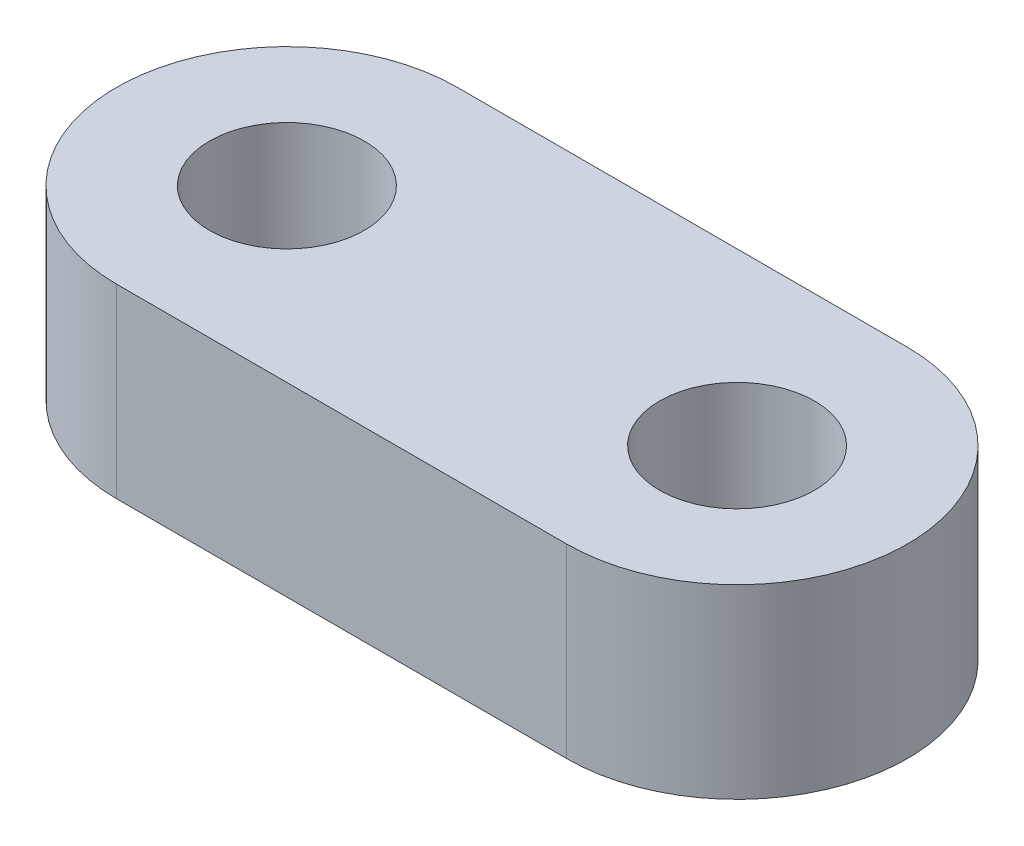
ISO-10303-21;
HEADER;
FILE_DESCRIPTION(('STEP AP214'),'2;1');
FILE_NAME('part.step','',(''),(''),'','','');
FILE_SCHEMA(('AUTOMOTIVE_DESIGN { 1 0 10303 214 1 1 1 1 }'));
ENDSEC;
DATA;
#1=APPLICATION_CONTEXT('core data for automotive mechanical design processes');
#2=APPLICATION_PROTOCOL_DEFINITION('international standard','automotive_design',2000,#1);
#3=PRODUCT_CONTEXT('',#1,'mechanical');
#4=PRODUCT('Part','Part','',(#3));
#5=PRODUCT_RELATED_PRODUCT_CATEGORY('part','',(#4));
#6=PRODUCT_DEFINITION_FORMATION('','',#4);
#7=PRODUCT_DEFINITION_CONTEXT('part definition',#1,'design');
#8=PRODUCT_DEFINITION('design','',#6,#7);
#9=PRODUCT_DEFINITION_SHAPE('','',#8);
#10=(LENGTH_UNIT() NAMED_UNIT(*) SI_UNIT(.MILLI.,.METRE.));
#11=(NAMED_UNIT(*) PLANE_ANGLE_UNIT() SI_UNIT($,.RADIAN.));
#12=(NAMED_UNIT(*) SI_UNIT($,.STERADIAN.) SOLID_ANGLE_UNIT());
#13=UNCERTAINTY_MEASURE_WITH_UNIT(LENGTH_MEASURE(1.E-05),#10,'distance_accuracy_value','');
#14=(GEOMETRIC_REPRESENTATION_CONTEXT(3) GLOBAL_UNCERTAINTY_ASSIGNED_CONTEXT((#13)) GLOBAL_UNIT_ASSIGNED_CONTEXT((#10,
#11,#12)) REPRESENTATION_CONTEXT('',''));
#15=CARTESIAN_POINT('',(0.,0.,0.));
#16=DIRECTION('',(0.,0.,1.));
#17=DIRECTION('',(1.,0.,0.));
#18=AXIS2_PLACEMENT_3D('',#15,#16,#17);
#19=CARTESIAN_POINT('',(14.53,3.00000000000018,0.));
#20=DIRECTION('',(0.,1.,0.));
#21=DIRECTION('',(-1.,0.,0.));
#22=AXIS2_PLACEMENT_3D('',#19,#20,#21);
#23=CYLINDRICAL_SURFACE('',#22,2.5);
#24=CARTESIAN_POINT('',(14.53,3.00000000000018,0.));
#25=DIRECTION('',(0.,1.,0.));
#26=DIRECTION('',(-1.,0.,0.));
#27=AXIS2_PLACEMENT_3D('',#24,#25,#26);
#28=CIRCLE('',#27,2.5);
#29=CARTESIAN_POINT('',(12.03,3.00000000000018,0.));
#30=VERTEX_POINT('',#29);
#31=EDGE_CURVE('E81',#30,#30,#28,.T.);
#32=ORIENTED_EDGE('',*,*,#31,.T.);
#33=EDGE_LOOP('',(#32));
#34=FACE_BOUND('',#33,.T.);
#35=CARTESIAN_POINT('',(14.53,-2.99999999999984,0.));
#36=DIRECTION('',(0.,1.,0.));
#37=DIRECTION('',(-1.,0.,0.));
#38=AXIS2_PLACEMENT_3D('',#35,#36,#37);
#39=CIRCLE('',#38,2.5);
#40=CARTESIAN_POINT('',(12.03,-2.99999999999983,0.));
#41=VERTEX_POINT('',#40);
#42=EDGE_CURVE('E18',#41,#41,#39,.T.);
#43=ORIENTED_EDGE('',*,*,#42,.F.);
#44=EDGE_LOOP('',(#43));
#45=FACE_BOUND('',#44,.T.);
#46=ADVANCED_FACE('F14',(#34,#45),#23,.F.);
#47=CARTESIAN_POINT('',(0.,3.00000000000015,0.));
#48=DIRECTION('',(0.,1.,0.));
#49=DIRECTION('',(-1.,0.,0.));
#50=AXIS2_PLACEMENT_3D('',#47,#48,#49);
#51=CYLINDRICAL_SURFACE('',#50,2.5);
#52=CARTESIAN_POINT('',(0.,3.00000000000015,0.));
#53=DIRECTION('',(0.,1.,0.));
#54=DIRECTION('',(-1.,0.,0.));
#55=AXIS2_PLACEMENT_3D('',#52,#53,#54);
#56=CIRCLE('',#55,2.5);
#57=CARTESIAN_POINT('',(-2.49999999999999,3.00000000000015,0.));
#58=VERTEX_POINT('',#57);
#59=EDGE_CURVE('E84',#58,#58,#56,.T.);
#60=ORIENTED_EDGE('',*,*,#59,.T.);
#61=EDGE_LOOP('',(#60));
#62=FACE_BOUND('',#61,.T.);
#63=CARTESIAN_POINT('',(0.,-2.99999999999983,0.));
#64=DIRECTION('',(0.,1.,0.));
#65=DIRECTION('',(-1.,0.,0.));
#66=AXIS2_PLACEMENT_3D('',#63,#64,#65);
#67=CIRCLE('',#66,2.5);
#68=CARTESIAN_POINT('',(-2.5,-2.99999999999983,0.));
#69=VERTEX_POINT('',#68);
#70=EDGE_CURVE('E75',#69,#69,#67,.T.);
#71=ORIENTED_EDGE('',*,*,#70,.F.);
#72=EDGE_LOOP('',(#71));
#73=FACE_BOUND('',#72,.T.);
#74=ADVANCED_FACE('F155',(#62,#73),#51,.F.);
#75=CARTESIAN_POINT('',(0.,1.83880688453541E-13,-5.50000000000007));
#76=DIRECTION('',(0.,0.,1.));
#77=DIRECTION('',(-1.,0.,0.));
#78=AXIS2_PLACEMENT_3D('',#75,#76,#77);
#79=PLANE('',#78);
#80=DIRECTION('',(0.,1.,0.));
#81=VECTOR('',#80,1.);
#82=CARTESIAN_POINT('',(14.53,1.6306400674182E-13,-5.50000000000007));
#83=LINE('',#82,#81);
#84=CARTESIAN_POINT('',(14.53,-2.99999999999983,-5.5));
#85=VERTEX_POINT('',#84);
#86=CARTESIAN_POINT('',(14.53,3.00000000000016,-5.50000000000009));
#87=VERTEX_POINT('',#86);
#88=EDGE_CURVE('E54',#85,#87,#83,.T.);
#89=ORIENTED_EDGE('',*,*,#88,.F.);
#90=DIRECTION('',(-1.,0.,0.));
#91=VECTOR('',#90,1.);
#92=CARTESIAN_POINT('',(0.,-2.99999999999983,-5.5));
#93=LINE('',#92,#91);
#94=CARTESIAN_POINT('',(0.,-2.99999999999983,-5.5));
#95=VERTEX_POINT('',#94);
#96=EDGE_CURVE('E69',#95,#85,#93,.F.);
#97=ORIENTED_EDGE('',*,*,#96,.F.);
#98=DIRECTION('',(0.,-1.,0.));
#99=VECTOR('',#98,1.);
#100=CARTESIAN_POINT('',(0.,1.83880688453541E-13,-5.50000000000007));
#101=LINE('',#100,#99);
#102=CARTESIAN_POINT('',(0.,3.00000000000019,-5.50000000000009));
#103=VERTEX_POINT('',#102);
#104=EDGE_CURVE('E59',#103,#95,#101,.T.);
#105=ORIENTED_EDGE('',*,*,#104,.F.);
#106=DIRECTION('',(1.,0.,0.));
#107=VECTOR('',#106,1.);
#108=CARTESIAN_POINT('',(0.,3.00000000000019,-5.50000000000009));
#109=LINE('',#108,#107);
#110=EDGE_CURVE('E89',#103,#87,#109,.T.);
#111=ORIENTED_EDGE('',*,*,#110,.T.);
#112=EDGE_LOOP('',(#89,#97,#105,#111));
#113=FACE_BOUND('',#112,.T.);
#114=ADVANCED_FACE('F73',(#113),#79,.F.);
#115=CARTESIAN_POINT('',(14.53,1.80411241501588E-13,0.));
#116=DIRECTION('',(0.,1.,0.));
#117=DIRECTION('',(-1.,0.,0.));
#118=AXIS2_PLACEMENT_3D('',#115,#116,#117);
#119=CYLINDRICAL_SURFACE('',#118,5.5);
#120=DIRECTION('',(0.,-1.,0.));
#121=VECTOR('',#120,1.);
#122=CARTESIAN_POINT('',(14.53,1.97758476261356E-13,5.5));
#123=LINE('',#122,#121);
#124=CARTESIAN_POINT('',(14.53,3.00000000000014,5.5));
#125=VERTEX_POINT('',#124);
#126=CARTESIAN_POINT('',(14.53,-2.99999999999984,5.5));
#127=VERTEX_POINT('',#126);
#128=EDGE_CURVE('E93',#125,#127,#123,.T.);
#129=ORIENTED_EDGE('',*,*,#128,.T.);
#130=CARTESIAN_POINT('',(14.53,-2.99999999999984,0.));
#131=DIRECTION('',(0.,1.,0.));
#132=DIRECTION('',(-1.,0.,0.));
#133=AXIS2_PLACEMENT_3D('',#130,#131,#132);
#134=CIRCLE('',#133,5.5);
#135=EDGE_CURVE('E74',#127,#85,#134,.T.);
#136=ORIENTED_EDGE('',*,*,#135,.T.);
#137=ORIENTED_EDGE('',*,*,#88,.T.);
#138=CARTESIAN_POINT('',(14.53,3.00000000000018,0.));
#139=DIRECTION('',(0.,1.,0.));
#140=DIRECTION('',(-1.,0.,0.));
#141=AXIS2_PLACEMENT_3D('',#138,#139,#140);
#142=CIRCLE('',#141,5.5);
#143=EDGE_CURVE('E24',#87,#125,#142,.F.);
#144=ORIENTED_EDGE('',*,*,#143,.T.);
#145=EDGE_LOOP('',(#129,#136,#137,#144));
#146=FACE_BOUND('',#145,.T.);
#147=ADVANCED_FACE('F100',(#146),#119,.T.);
#148=CARTESIAN_POINT('',(0.,1.66533453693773E-13,5.5));
#149=DIRECTION('',(0.,0.,-1.));
#150=DIRECTION('',(1.,0.,0.));
#151=AXIS2_PLACEMENT_3D('',#148,#149,#150);
#152=PLANE('',#151);
#153=DIRECTION('',(0.,1.,0.));
#154=VECTOR('',#153,1.);
#155=CARTESIAN_POINT('',(0.,1.66533453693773E-13,5.5));
#156=LINE('',#155,#154);
#157=CARTESIAN_POINT('',(0.,-2.99999999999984,5.5));
#158=VERTEX_POINT('',#157);
#159=CARTESIAN_POINT('',(0.,3.00000000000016,5.5));
#160=VERTEX_POINT('',#159);
#161=EDGE_CURVE('E85',#158,#160,#156,.T.);
#162=ORIENTED_EDGE('',*,*,#161,.F.);
#163=DIRECTION('',(1.,0.,0.));
#164=VECTOR('',#163,1.);
#165=CARTESIAN_POINT('',(0.,-2.99999999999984,5.5));
#166=LINE('',#165,#164);
#167=EDGE_CURVE('E71',#127,#158,#166,.F.);
#168=ORIENTED_EDGE('',*,*,#167,.F.);
#169=ORIENTED_EDGE('',*,*,#128,.F.);
#170=DIRECTION('',(1.,0.,0.));
#171=VECTOR('',#170,1.);
#172=CARTESIAN_POINT('',(0.,3.00000000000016,5.5));
#173=LINE('',#172,#171);
#174=EDGE_CURVE('E9',#125,#160,#173,.F.);
#175=ORIENTED_EDGE('',*,*,#174,.T.);
#176=EDGE_LOOP('',(#162,#168,#169,#175));
#177=FACE_BOUND('',#176,.T.);
#178=ADVANCED_FACE('F102',(#177),#152,.F.);
#179=CARTESIAN_POINT('',(0.,1.49186218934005E-13,0.));
#180=DIRECTION('',(0.,1.,0.));
#181=DIRECTION('',(-1.,0.,0.));
#182=AXIS2_PLACEMENT_3D('',#179,#180,#181);
#183=CYLINDRICAL_SURFACE('',#182,5.5);
#184=ORIENTED_EDGE('',*,*,#161,.T.);
#185=CARTESIAN_POINT('',(0.,3.00000000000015,0.));
#186=DIRECTION('',(0.,1.,0.));
#187=DIRECTION('',(-1.,0.,0.));
#188=AXIS2_PLACEMENT_3D('',#185,#186,#187);
#189=CIRCLE('',#188,5.5);
#190=EDGE_CURVE('E33',#160,#103,#189,.F.);
#191=ORIENTED_EDGE('',*,*,#190,.T.);
#192=ORIENTED_EDGE('',*,*,#104,.T.);
#193=CARTESIAN_POINT('',(0.,-2.99999999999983,0.));
#194=DIRECTION('',(0.,1.,0.));
#195=DIRECTION('',(-1.,0.,0.));
#196=AXIS2_PLACEMENT_3D('',#193,#194,#195);
#197=CIRCLE('',#196,5.5);
#198=EDGE_CURVE('E62',#95,#158,#197,.T.);
#199=ORIENTED_EDGE('',*,*,#198,.T.);
#200=EDGE_LOOP('',(#184,#191,#192,#199));
#201=FACE_BOUND('',#200,.T.);
#202=ADVANCED_FACE('F61',(#201),#183,.T.);
#203=CARTESIAN_POINT('',(0.,3.00000000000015,0.));
#204=DIRECTION('',(0.,-1.,0.));
#205=DIRECTION('',(1.,0.,0.));
#206=AXIS2_PLACEMENT_3D('',#203,#204,#205);
#207=PLANE('',#206);
#208=ORIENTED_EDGE('',*,*,#174,.F.);
#209=ORIENTED_EDGE('',*,*,#143,.F.);
#210=ORIENTED_EDGE('',*,*,#110,.F.);
#211=ORIENTED_EDGE('',*,*,#190,.F.);
#212=EDGE_LOOP('',(#208,#209,#210,#211));
#213=FACE_BOUND('',#212,.T.);
#214=ORIENTED_EDGE('',*,*,#59,.F.);
#215=EDGE_LOOP('',(#214));
#216=FACE_BOUND('',#215,.T.);
#217=ORIENTED_EDGE('',*,*,#31,.F.);
#218=EDGE_LOOP('',(#217));
#219=FACE_BOUND('',#218,.T.);
#220=ADVANCED_FACE('F97',(#213,#216,#219),#207,.F.);
#221=CARTESIAN_POINT('',(0.,-2.99999999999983,0.));
#222=DIRECTION('',(0.,-1.,0.));
#223=DIRECTION('',(1.,0.,0.));
#224=AXIS2_PLACEMENT_3D('',#221,#222,#223);
#225=PLANE('',#224);
#226=ORIENTED_EDGE('',*,*,#135,.F.);
#227=ORIENTED_EDGE('',*,*,#167,.T.);
#228=ORIENTED_EDGE('',*,*,#198,.F.);
#229=ORIENTED_EDGE('',*,*,#96,.T.);
#230=EDGE_LOOP('',(#226,#227,#228,#229));
#231=FACE_BOUND('',#230,.T.);
#232=ORIENTED_EDGE('',*,*,#70,.T.);
#233=EDGE_LOOP('',(#232));
#234=FACE_BOUND('',#233,.T.);
#235=ORIENTED_EDGE('',*,*,#42,.T.);
#236=EDGE_LOOP('',(#235));
#237=FACE_BOUND('',#236,.T.);
#238=ADVANCED_FACE('F16',(#231,#234,#237),#225,.T.);
#239=CLOSED_SHELL('',(#46,#74,#114,#147,#178,#202,#220,#238));
#240=MANIFOLD_SOLID_BREP('B1',#239);
#241=ADVANCED_BREP_SHAPE_REPRESENTATION('',(#18,#240),#14);
#242=SHAPE_DEFINITION_REPRESENTATION(#9,#241);
ENDSEC;
END-ISO-10303-21;
